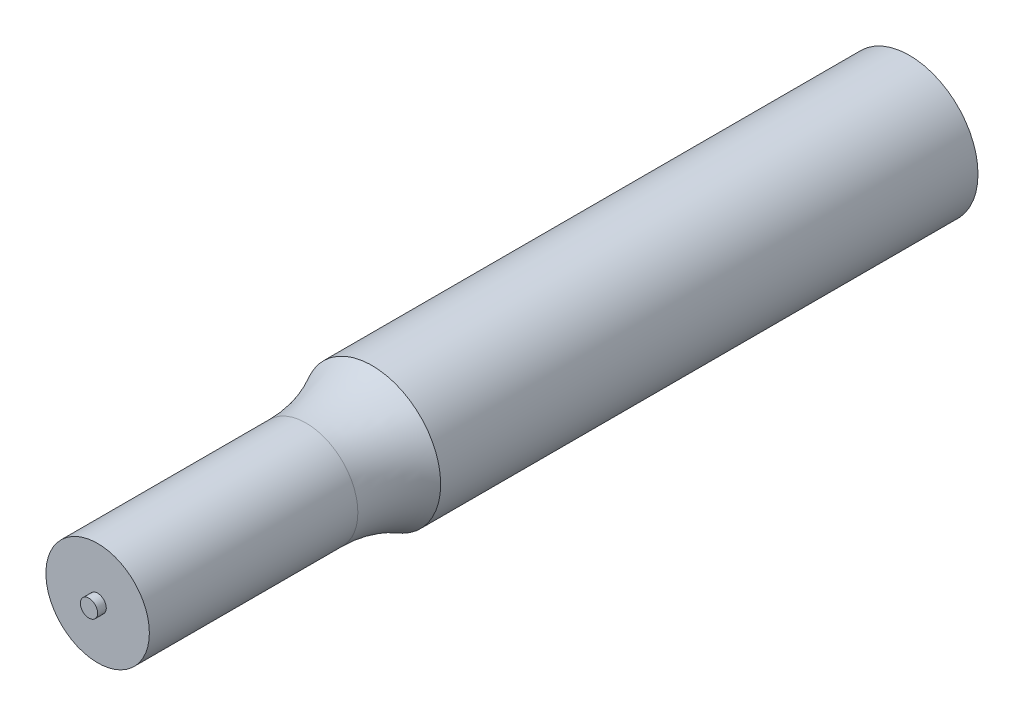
from build123d import *

# Parameters (mm, degrees)
LOGO3_BIB4_W = 0.8001
LOGO3_BIB4_H = 1.6002


with BuildPart() as part:
    # logo3_bib2 → Revolve2_Shoulder (revolve)
    with BuildSketch(Plane(origin=(0, 0, 0), x_dir=(1, 0, 0), z_dir=(0, 1, 0)), mode=Mode.PRIVATE) as revolve2_shoulder_sk:
        with BuildLine():
            Line((-6.35, -6.35), (0, -6.35))
            Line((0, -6.35), (0, -81.4832))
            Line((0, -81.4832), (-4.7879, -81.4832))
            Line((-4.7879, -81.4832), (-4.7879, -62.185427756))
            ThreePointArc((-4.7879, -62.185427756), (-5.184621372, -59.035930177), (-6.35, -56.0832))
            Line((-6.35, -56.0832), (-6.35, -6.35))
        make_face()
    revolve(revolve2_shoulder_sk.sketch.rotate(Axis((0, 0, 43.517168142), (0, 0, -1)), 180), axis=Axis((0, 0, 43.517168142), (0, 0, -1)))

    # logo3_bib4 → Revolve2_Shoulder_JT (revolve)
    with BuildSketch(Plane(origin=(0, 0, 0), x_dir=(1, 0, 0), z_dir=(0, 1, 0))):
        with Locations((-0.40005, -81.4832)):
            Rectangle(LOGO3_BIB4_W, LOGO3_BIB4_H)
    revolve(axis=Axis((0, 0, 0), (0, 0, 1)))

    # Sketch1_2 → Cut-Revolve_Ball_Shoulder (revolve, cut)
    with BuildSketch(Plane(origin=(0, 0, 0), x_dir=(1, 0, 0), z_dir=(0, 1, 0))):
        with BuildLine():
            Line((-15.531628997, -25.178899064), (-9.398, -2.287884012))
            Line((-9.398, -2.287884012), (-9.398, -33.1724))
            ThreePointArc((-9.398, -33.1724), (-14.435793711, -30.688035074), (-15.531628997, -25.178899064))
        make_face()
    revolve(axis=Axis((-9.398, 0, 12.118432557), (0, 0, 1)), mode=Mode.SUBTRACT)


solid = part.part
